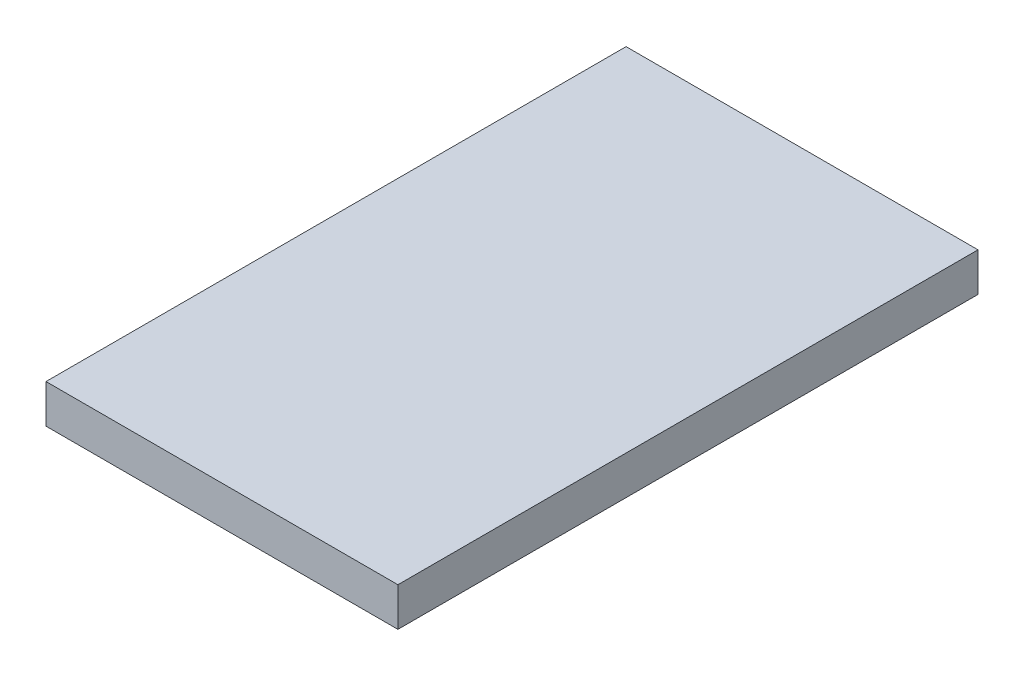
from build123d import *

# Parameters (mm, degrees)
SKETCH1_W      = 91
SKETCH1_H      = 10
EXTRUDE1_DEPTH = 150


with BuildPart() as part:
    # Sketch1 → Extrude1 (new body)
    with BuildSketch(Plane.XY):
        with Locations((0, 5)):
            Rectangle(SKETCH1_W, SKETCH1_H)
    extrude(amount=EXTRUDE1_DEPTH)


solid = part.part
